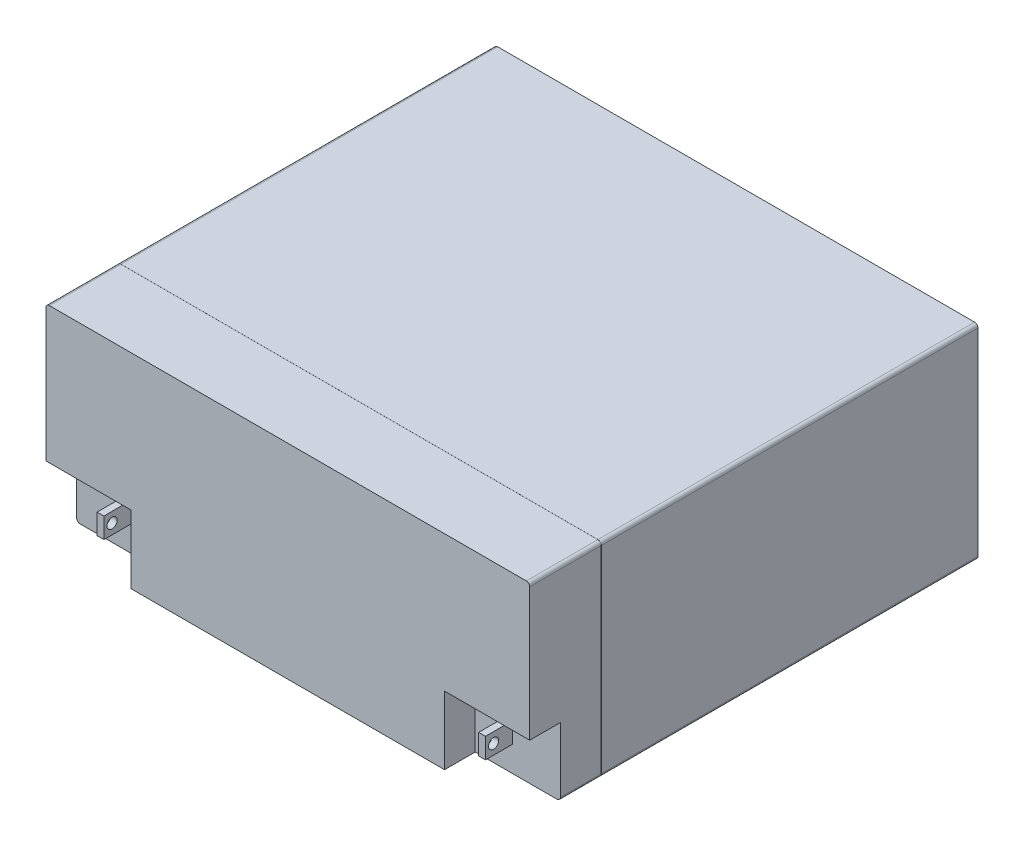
ISO-10303-21;
HEADER;
FILE_DESCRIPTION(('STEP AP214'),'2;1');
FILE_NAME('part.step','',(''),(''),'','','');
FILE_SCHEMA(('AUTOMOTIVE_DESIGN { 1 0 10303 214 1 1 1 1 }'));
ENDSEC;
DATA;
#1=APPLICATION_CONTEXT('core data for automotive mechanical design processes');
#2=APPLICATION_PROTOCOL_DEFINITION('international standard','automotive_design',2000,#1);
#3=PRODUCT_CONTEXT('',#1,'mechanical');
#4=PRODUCT('Part','Part','',(#3));
#5=PRODUCT_RELATED_PRODUCT_CATEGORY('part','',(#4));
#6=PRODUCT_DEFINITION_FORMATION('','',#4);
#7=PRODUCT_DEFINITION_CONTEXT('part definition',#1,'design');
#8=PRODUCT_DEFINITION('design','',#6,#7);
#9=PRODUCT_DEFINITION_SHAPE('','',#8);
#10=(LENGTH_UNIT() NAMED_UNIT(*) SI_UNIT(.MILLI.,.METRE.));
#11=(NAMED_UNIT(*) PLANE_ANGLE_UNIT() SI_UNIT($,.RADIAN.));
#12=(NAMED_UNIT(*) SI_UNIT($,.STERADIAN.) SOLID_ANGLE_UNIT());
#13=UNCERTAINTY_MEASURE_WITH_UNIT(LENGTH_MEASURE(1.E-05),#10,'distance_accuracy_value','');
#14=(GEOMETRIC_REPRESENTATION_CONTEXT(3) GLOBAL_UNCERTAINTY_ASSIGNED_CONTEXT((#13)) GLOBAL_UNIT_ASSIGNED_CONTEXT((#10,
#11,#12)) REPRESENTATION_CONTEXT('',''));
#15=CARTESIAN_POINT('',(0.,0.,0.));
#16=DIRECTION('',(0.,0.,1.));
#17=DIRECTION('',(1.,0.,0.));
#18=AXIS2_PLACEMENT_3D('',#15,#16,#17);
#19=CARTESIAN_POINT('',(72.39,-62.865,77.216));
#20=DIRECTION('',(1.,0.,0.));
#21=DIRECTION('',(0.,0.,1.));
#22=AXIS2_PLACEMENT_3D('',#19,#20,#21);
#23=PLANE('',#22);
#24=DIRECTION('',(0.,-1.,0.));
#25=VECTOR('',#24,1.);
#26=CARTESIAN_POINT('',(72.39,-62.865,72.136));
#27=LINE('',#26,#25);
#28=CARTESIAN_POINT('',(72.39,-59.055,72.136));
#29=VERTEX_POINT('',#28);
#30=CARTESIAN_POINT('',(72.39,-66.675,72.136));
#31=VERTEX_POINT('',#30);
#32=EDGE_CURVE('E482',#29,#31,#27,.T.);
#33=ORIENTED_EDGE('',*,*,#32,.F.);
#34=DIRECTION('',(0.,0.,1.));
#35=VECTOR('',#34,1.);
#36=CARTESIAN_POINT('',(72.39,-59.055,77.216));
#37=LINE('',#36,#35);
#38=CARTESIAN_POINT('',(72.39,-59.055,82.296));
#39=VERTEX_POINT('',#38);
#40=EDGE_CURVE('E392',#29,#39,#37,.T.);
#41=ORIENTED_EDGE('',*,*,#40,.T.);
#42=DIRECTION('',(0.,-1.,0.));
#43=VECTOR('',#42,1.);
#44=CARTESIAN_POINT('',(72.39,-62.865,82.296));
#45=LINE('',#44,#43);
#46=CARTESIAN_POINT('',(72.39,-66.675,82.296));
#47=VERTEX_POINT('',#46);
#48=EDGE_CURVE('E333',#39,#47,#45,.T.);
#49=ORIENTED_EDGE('',*,*,#48,.T.);
#50=DIRECTION('',(0.,0.,1.));
#51=VECTOR('',#50,1.);
#52=CARTESIAN_POINT('',(72.39,-66.675,77.216));
#53=LINE('',#52,#51);
#54=EDGE_CURVE('E21',#31,#47,#53,.T.);
#55=ORIENTED_EDGE('',*,*,#54,.F.);
#56=EDGE_LOOP('',(#33,#41,#49,#55));
#57=FACE_BOUND('',#56,.T.);
#58=CARTESIAN_POINT('',(72.39,-62.865,79.248));
#59=DIRECTION('',(1.,0.,0.));
#60=DIRECTION('',(0.,0.,-1.));
#61=AXIS2_PLACEMENT_3D('',#58,#59,#60);
#62=CIRCLE('',#61,1.905);
#63=CARTESIAN_POINT('',(72.39,-62.865,77.343));
#64=VERTEX_POINT('',#63);
#65=EDGE_CURVE('E38',#64,#64,#62,.T.);
#66=ORIENTED_EDGE('',*,*,#65,.F.);
#67=EDGE_LOOP('',(#66));
#68=FACE_BOUND('',#67,.T.);
#69=ADVANCED_FACE('F17',(#57,#68),#23,.T.);
#70=CARTESIAN_POINT('',(69.85,-62.865,77.216));
#71=DIRECTION('',(1.,0.,0.));
#72=DIRECTION('',(0.,0.,1.));
#73=AXIS2_PLACEMENT_3D('',#70,#71,#72);
#74=PLANE('',#73);
#75=DIRECTION('',(0.,-1.,0.));
#76=VECTOR('',#75,1.);
#77=CARTESIAN_POINT('',(69.85,-62.865,72.136));
#78=LINE('',#77,#76);
#79=CARTESIAN_POINT('',(69.85,-59.055,72.136));
#80=VERTEX_POINT('',#79);
#81=CARTESIAN_POINT('',(69.85,-66.675,72.136));
#82=VERTEX_POINT('',#81);
#83=EDGE_CURVE('E316',#80,#82,#78,.T.);
#84=ORIENTED_EDGE('',*,*,#83,.T.);
#85=DIRECTION('',(0.,0.,1.));
#86=VECTOR('',#85,1.);
#87=CARTESIAN_POINT('',(69.85,-66.675,77.216));
#88=LINE('',#87,#86);
#89=CARTESIAN_POINT('',(69.85,-66.675,82.296));
#90=VERTEX_POINT('',#89);
#91=EDGE_CURVE('E11',#82,#90,#88,.T.);
#92=ORIENTED_EDGE('',*,*,#91,.T.);
#93=DIRECTION('',(0.,-1.,0.));
#94=VECTOR('',#93,1.);
#95=CARTESIAN_POINT('',(69.85,-62.865,82.296));
#96=LINE('',#95,#94);
#97=CARTESIAN_POINT('',(69.85,-59.055,82.296));
#98=VERTEX_POINT('',#97);
#99=EDGE_CURVE('E313',#98,#90,#96,.T.);
#100=ORIENTED_EDGE('',*,*,#99,.F.);
#101=DIRECTION('',(0.,0.,1.));
#102=VECTOR('',#101,1.);
#103=CARTESIAN_POINT('',(69.85,-59.055,77.216));
#104=LINE('',#103,#102);
#105=EDGE_CURVE('E396',#80,#98,#104,.T.);
#106=ORIENTED_EDGE('',*,*,#105,.F.);
#107=EDGE_LOOP('',(#84,#92,#100,#106));
#108=FACE_BOUND('',#107,.T.);
#109=CARTESIAN_POINT('',(69.85,-62.865,79.248));
#110=DIRECTION('',(1.,0.,0.));
#111=DIRECTION('',(0.,0.,-1.));
#112=AXIS2_PLACEMENT_3D('',#109,#110,#111);
#113=CIRCLE('',#112,1.905);
#114=CARTESIAN_POINT('',(69.85,-62.865,77.343));
#115=VERTEX_POINT('',#114);
#116=EDGE_CURVE('E326',#115,#115,#113,.T.);
#117=ORIENTED_EDGE('',*,*,#116,.T.);
#118=EDGE_LOOP('',(#117));
#119=FACE_BOUND('',#118,.T.);
#120=ADVANCED_FACE('F19',(#108,#119),#74,.F.);
#121=CARTESIAN_POINT('',(69.85,-66.675,77.216));
#122=DIRECTION('',(0.,1.,0.));
#123=DIRECTION('',(1.,0.,0.));
#124=AXIS2_PLACEMENT_3D('',#121,#122,#123);
#125=PLANE('',#124);
#126=ORIENTED_EDGE('',*,*,#54,.T.);
#127=DIRECTION('',(1.,0.,0.));
#128=VECTOR('',#127,1.);
#129=CARTESIAN_POINT('',(69.85,-66.675,82.296));
#130=LINE('',#129,#128);
#131=EDGE_CURVE('E321',#90,#47,#130,.T.);
#132=ORIENTED_EDGE('',*,*,#131,.F.);
#133=ORIENTED_EDGE('',*,*,#91,.F.);
#134=DIRECTION('',(1.,0.,0.));
#135=VECTOR('',#134,1.);
#136=CARTESIAN_POINT('',(69.85,-66.675,72.136));
#137=LINE('',#136,#135);
#138=EDGE_CURVE('E397',#82,#31,#137,.T.);
#139=ORIENTED_EDGE('',*,*,#138,.T.);
#140=EDGE_LOOP('',(#126,#132,#133,#139));
#141=FACE_BOUND('',#140,.T.);
#142=ADVANCED_FACE('F322',(#141),#125,.F.);
#143=CARTESIAN_POINT('',(69.85,-62.865,79.248));
#144=DIRECTION('',(1.,0.,0.));
#145=DIRECTION('',(0.,0.,-1.));
#146=AXIS2_PLACEMENT_3D('',#143,#144,#145);
#147=CYLINDRICAL_SURFACE('',#146,1.905);
#148=ORIENTED_EDGE('',*,*,#65,.T.);
#149=EDGE_LOOP('',(#148));
#150=FACE_BOUND('',#149,.T.);
#151=ORIENTED_EDGE('',*,*,#116,.F.);
#152=EDGE_LOOP('',(#151));
#153=FACE_BOUND('',#152,.T.);
#154=ADVANCED_FACE('F995',(#150,#153),#147,.F.);
#155=CARTESIAN_POINT('',(69.85,-62.865,82.296));
#156=DIRECTION('',(0.,0.,1.));
#157=DIRECTION('',(1.,0.,0.));
#158=AXIS2_PLACEMENT_3D('',#155,#156,#157);
#159=PLANE('',#158);
#160=ORIENTED_EDGE('',*,*,#48,.F.);
#161=DIRECTION('',(1.,0.,0.));
#162=VECTOR('',#161,1.);
#163=CARTESIAN_POINT('',(69.85,-59.055,82.296));
#164=LINE('',#163,#162);
#165=EDGE_CURVE('E330',#98,#39,#164,.T.);
#166=ORIENTED_EDGE('',*,*,#165,.F.);
#167=ORIENTED_EDGE('',*,*,#99,.T.);
#168=ORIENTED_EDGE('',*,*,#131,.T.);
#169=EDGE_LOOP('',(#160,#166,#167,#168));
#170=FACE_BOUND('',#169,.T.);
#171=ADVANCED_FACE('F328',(#170),#159,.T.);
#172=CARTESIAN_POINT('',(69.85,-59.055,77.216));
#173=DIRECTION('',(0.,1.,0.));
#174=DIRECTION('',(1.,0.,0.));
#175=AXIS2_PLACEMENT_3D('',#172,#173,#174);
#176=PLANE('',#175);
#177=ORIENTED_EDGE('',*,*,#40,.F.);
#178=DIRECTION('',(1.,0.,0.));
#179=VECTOR('',#178,1.);
#180=CARTESIAN_POINT('',(69.85,-59.055,72.136));
#181=LINE('',#180,#179);
#182=EDGE_CURVE('E478',#80,#29,#181,.T.);
#183=ORIENTED_EDGE('',*,*,#182,.F.);
#184=ORIENTED_EDGE('',*,*,#105,.T.);
#185=ORIENTED_EDGE('',*,*,#165,.T.);
#186=EDGE_LOOP('',(#177,#183,#184,#185));
#187=FACE_BOUND('',#186,.T.);
#188=ADVANCED_FACE('F993',(#187),#176,.T.);
#189=CARTESIAN_POINT('',(0.,-38.1,72.136));
#190=DIRECTION('',(0.,0.,1.));
#191=DIRECTION('',(1.,0.,0.));
#192=AXIS2_PLACEMENT_3D('',#189,#190,#191);
#193=PLANE('',#192);
#194=DIRECTION('',(0.,1.,0.));
#195=VECTOR('',#194,1.);
#196=CARTESIAN_POINT('',(58.42,-63.5,72.136));
#197=LINE('',#196,#195);
#198=CARTESIAN_POINT('',(58.42,-76.2,72.136));
#199=VERTEX_POINT('',#198);
#200=CARTESIAN_POINT('',(58.42,-50.8,72.136));
#201=VERTEX_POINT('',#200);
#202=EDGE_CURVE('E369',#199,#201,#197,.T.);
#203=ORIENTED_EDGE('',*,*,#202,.F.);
#204=DIRECTION('',(-1.,0.,0.));
#205=VECTOR('',#204,1.);
#206=CARTESIAN_POINT('',(0.,-76.2,72.136));
#207=LINE('',#206,#205);
#208=CARTESIAN_POINT('',(88.9,-76.2,72.136));
#209=VERTEX_POINT('',#208);
#210=EDGE_CURVE('E499',#209,#199,#207,.T.);
#211=ORIENTED_EDGE('',*,*,#210,.F.);
#212=CARTESIAN_POINT('',(88.9,-74.93,72.136));
#213=DIRECTION('',(0.,0.,1.));
#214=DIRECTION('',(-1.,0.,0.));
#215=AXIS2_PLACEMENT_3D('',#212,#213,#214);
#216=CIRCLE('',#215,1.27);
#217=CARTESIAN_POINT('',(90.17,-74.93,72.136));
#218=VERTEX_POINT('',#217);
#219=EDGE_CURVE('E588',#209,#218,#216,.T.);
#220=ORIENTED_EDGE('',*,*,#219,.T.);
#221=DIRECTION('',(0.,1.,0.));
#222=VECTOR('',#221,1.);
#223=CARTESIAN_POINT('',(90.17,-76.2,72.136));
#224=LINE('',#223,#222);
#225=CARTESIAN_POINT('',(90.17,-50.8,72.136));
#226=VERTEX_POINT('',#225);
#227=EDGE_CURVE('E513',#218,#226,#224,.T.);
#228=ORIENTED_EDGE('',*,*,#227,.T.);
#229=DIRECTION('',(-1.,0.,0.));
#230=VECTOR('',#229,1.);
#231=CARTESIAN_POINT('',(74.295,-50.8,72.136));
#232=LINE('',#231,#230);
#233=EDGE_CURVE('E479',#226,#201,#232,.T.);
#234=ORIENTED_EDGE('',*,*,#233,.T.);
#235=EDGE_LOOP('',(#203,#211,#220,#228,#234));
#236=FACE_BOUND('',#235,.T.);
#237=ORIENTED_EDGE('',*,*,#83,.F.);
#238=ORIENTED_EDGE('',*,*,#182,.T.);
#239=ORIENTED_EDGE('',*,*,#32,.T.);
#240=ORIENTED_EDGE('',*,*,#138,.F.);
#241=EDGE_LOOP('',(#237,#238,#239,#240));
#242=FACE_BOUND('',#241,.T.);
#243=ADVANCED_FACE('F760',(#236,#242),#193,.T.);
#244=CARTESIAN_POINT('',(74.295,-50.8,72.136));
#245=DIRECTION('',(0.,1.,0.));
#246=DIRECTION('',(1.,0.,0.));
#247=AXIS2_PLACEMENT_3D('',#244,#245,#246);
#248=PLANE('',#247);
#249=DIRECTION('',(-1.,0.,0.));
#250=VECTOR('',#249,1.);
#251=CARTESIAN_POINT('',(74.295,-50.8,83.566));
#252=LINE('',#251,#250);
#253=CARTESIAN_POINT('',(90.17,-50.8,83.566));
#254=VERTEX_POINT('',#253);
#255=CARTESIAN_POINT('',(58.42,-50.8,83.566));
#256=VERTEX_POINT('',#255);
#257=EDGE_CURVE('E563',#254,#256,#252,.T.);
#258=ORIENTED_EDGE('',*,*,#257,.T.);
#259=DIRECTION('',(0.,0.,1.));
#260=VECTOR('',#259,1.);
#261=CARTESIAN_POINT('',(58.42,-50.8,72.136));
#262=LINE('',#261,#260);
#263=EDGE_CURVE('E595',#201,#256,#262,.T.);
#264=ORIENTED_EDGE('',*,*,#263,.F.);
#265=ORIENTED_EDGE('',*,*,#233,.F.);
#266=DIRECTION('',(0.,0.,1.));
#267=VECTOR('',#266,1.);
#268=CARTESIAN_POINT('',(90.17,-50.8,72.136));
#269=LINE('',#268,#267);
#270=EDGE_CURVE('E523',#226,#254,#269,.T.);
#271=ORIENTED_EDGE('',*,*,#270,.T.);
#272=EDGE_LOOP('',(#258,#264,#265,#271));
#273=FACE_BOUND('',#272,.T.);
#274=ADVANCED_FACE('F858',(#273),#248,.F.);
#275=CARTESIAN_POINT('',(58.42,-63.5,72.136));
#276=DIRECTION('',(1.,0.,0.));
#277=DIRECTION('',(0.,1.,0.));
#278=AXIS2_PLACEMENT_3D('',#275,#276,#277);
#279=PLANE('',#278);
#280=DIRECTION('',(0.,1.,0.));
#281=VECTOR('',#280,1.);
#282=CARTESIAN_POINT('',(58.42,-63.5,83.566));
#283=LINE('',#282,#281);
#284=CARTESIAN_POINT('',(58.42,-76.2,83.566));
#285=VERTEX_POINT('',#284);
#286=EDGE_CURVE('E620',#285,#256,#283,.T.);
#287=ORIENTED_EDGE('',*,*,#286,.F.);
#288=DIRECTION('',(0.,0.,1.));
#289=VECTOR('',#288,1.);
#290=CARTESIAN_POINT('',(58.42,-76.2,72.136));
#291=LINE('',#290,#289);
#292=EDGE_CURVE('E503',#199,#285,#291,.T.);
#293=ORIENTED_EDGE('',*,*,#292,.F.);
#294=ORIENTED_EDGE('',*,*,#202,.T.);
#295=ORIENTED_EDGE('',*,*,#263,.T.);
#296=EDGE_LOOP('',(#287,#293,#294,#295));
#297=FACE_BOUND('',#296,.T.);
#298=ADVANCED_FACE('F764',(#297),#279,.T.);
#299=CARTESIAN_POINT('',(0.,-38.1,72.136));
#300=DIRECTION('',(0.,0.,1.));
#301=DIRECTION('',(1.,0.,0.));
#302=AXIS2_PLACEMENT_3D('',#299,#300,#301);
#303=PLANE('',#302);
#304=DIRECTION('',(1.,0.,0.));
#305=VECTOR('',#304,1.);
#306=CARTESIAN_POINT('',(-74.295,-50.8,72.136));
#307=LINE('',#306,#305);
#308=CARTESIAN_POINT('',(-90.17,-50.8,72.136));
#309=VERTEX_POINT('',#308);
#310=CARTESIAN_POINT('',(-58.42,-50.8,72.136));
#311=VERTEX_POINT('',#310);
#312=EDGE_CURVE('E472',#309,#311,#307,.T.);
#313=ORIENTED_EDGE('',*,*,#312,.F.);
#314=DIRECTION('',(0.,1.,0.));
#315=VECTOR('',#314,1.);
#316=CARTESIAN_POINT('',(-90.17,-76.2,72.136));
#317=LINE('',#316,#315);
#318=CARTESIAN_POINT('',(-90.17,-74.93,72.136));
#319=VERTEX_POINT('',#318);
#320=EDGE_CURVE('E562',#319,#309,#317,.T.);
#321=ORIENTED_EDGE('',*,*,#320,.F.);
#322=CARTESIAN_POINT('',(-88.9,-74.93,72.136));
#323=DIRECTION('',(0.,0.,1.));
#324=DIRECTION('',(-1.,0.,0.));
#325=AXIS2_PLACEMENT_3D('',#322,#323,#324);
#326=CIRCLE('',#325,1.27);
#327=CARTESIAN_POINT('',(-88.9,-76.2,72.136));
#328=VERTEX_POINT('',#327);
#329=EDGE_CURVE('E543',#319,#328,#326,.T.);
#330=ORIENTED_EDGE('',*,*,#329,.T.);
#331=DIRECTION('',(-1.,0.,0.));
#332=VECTOR('',#331,1.);
#333=CARTESIAN_POINT('',(0.,-76.2,72.136));
#334=LINE('',#333,#332);
#335=CARTESIAN_POINT('',(-58.42,-76.2,72.136));
#336=VERTEX_POINT('',#335);
#337=EDGE_CURVE('E702',#336,#328,#334,.T.);
#338=ORIENTED_EDGE('',*,*,#337,.F.);
#339=DIRECTION('',(0.,1.,0.));
#340=VECTOR('',#339,1.);
#341=CARTESIAN_POINT('',(-58.42,-63.5,72.136));
#342=LINE('',#341,#340);
#343=EDGE_CURVE('E366',#336,#311,#342,.T.);
#344=ORIENTED_EDGE('',*,*,#343,.T.);
#345=EDGE_LOOP('',(#313,#321,#330,#338,#344));
#346=FACE_BOUND('',#345,.T.);
#347=DIRECTION('',(0.,-1.,0.));
#348=VECTOR('',#347,1.);
#349=CARTESIAN_POINT('',(-69.85,-62.865,72.136));
#350=LINE('',#349,#348);
#351=CARTESIAN_POINT('',(-69.85,-59.055,72.136));
#352=VERTEX_POINT('',#351);
#353=CARTESIAN_POINT('',(-69.85,-66.675,72.136));
#354=VERTEX_POINT('',#353);
#355=EDGE_CURVE('E713',#352,#354,#350,.T.);
#356=ORIENTED_EDGE('',*,*,#355,.T.);
#357=DIRECTION('',(-1.,0.,0.));
#358=VECTOR('',#357,1.);
#359=CARTESIAN_POINT('',(-69.85,-66.675,72.136));
#360=LINE('',#359,#358);
#361=CARTESIAN_POINT('',(-72.39,-66.675,72.136));
#362=VERTEX_POINT('',#361);
#363=EDGE_CURVE('E729',#354,#362,#360,.T.);
#364=ORIENTED_EDGE('',*,*,#363,.T.);
#365=DIRECTION('',(0.,-1.,0.));
#366=VECTOR('',#365,1.);
#367=CARTESIAN_POINT('',(-72.39,-62.865,72.136));
#368=LINE('',#367,#366);
#369=CARTESIAN_POINT('',(-72.39,-59.055,72.136));
#370=VERTEX_POINT('',#369);
#371=EDGE_CURVE('E688',#370,#362,#368,.T.);
#372=ORIENTED_EDGE('',*,*,#371,.F.);
#373=DIRECTION('',(-1.,0.,0.));
#374=VECTOR('',#373,1.);
#375=CARTESIAN_POINT('',(-69.85,-59.055,72.136));
#376=LINE('',#375,#374);
#377=EDGE_CURVE('E692',#352,#370,#376,.T.);
#378=ORIENTED_EDGE('',*,*,#377,.F.);
#379=EDGE_LOOP('',(#356,#364,#372,#378));
#380=FACE_BOUND('',#379,.T.);
#381=ADVANCED_FACE('F879',(#346,#380),#303,.T.);
#382=CARTESIAN_POINT('',(-58.42,-63.5,72.136));
#383=DIRECTION('',(1.,0.,0.));
#384=DIRECTION('',(0.,1.,0.));
#385=AXIS2_PLACEMENT_3D('',#382,#383,#384);
#386=PLANE('',#385);
#387=DIRECTION('',(0.,1.,0.));
#388=VECTOR('',#387,1.);
#389=CARTESIAN_POINT('',(-58.42,-63.5,83.566));
#390=LINE('',#389,#388);
#391=CARTESIAN_POINT('',(-58.42,-76.2,83.566));
#392=VERTEX_POINT('',#391);
#393=CARTESIAN_POINT('',(-58.42,-50.8,83.566));
#394=VERTEX_POINT('',#393);
#395=EDGE_CURVE('E613',#392,#394,#390,.T.);
#396=ORIENTED_EDGE('',*,*,#395,.T.);
#397=DIRECTION('',(0.,0.,1.));
#398=VECTOR('',#397,1.);
#399=CARTESIAN_POINT('',(-58.42,-50.8,72.136));
#400=LINE('',#399,#398);
#401=EDGE_CURVE('E370',#311,#394,#400,.T.);
#402=ORIENTED_EDGE('',*,*,#401,.F.);
#403=ORIENTED_EDGE('',*,*,#343,.F.);
#404=DIRECTION('',(0.,0.,1.));
#405=VECTOR('',#404,1.);
#406=CARTESIAN_POINT('',(-58.42,-76.2,72.136));
#407=LINE('',#406,#405);
#408=EDGE_CURVE('E707',#336,#392,#407,.T.);
#409=ORIENTED_EDGE('',*,*,#408,.T.);
#410=EDGE_LOOP('',(#396,#402,#403,#409));
#411=FACE_BOUND('',#410,.T.);
#412=ADVANCED_FACE('F775',(#411),#386,.F.);
#413=CARTESIAN_POINT('',(-74.295,-50.8,72.136));
#414=DIRECTION('',(0.,-1.,0.));
#415=DIRECTION('',(0.,0.,-1.));
#416=AXIS2_PLACEMENT_3D('',#413,#414,#415);
#417=PLANE('',#416);
#418=DIRECTION('',(1.,0.,0.));
#419=VECTOR('',#418,1.);
#420=CARTESIAN_POINT('',(-74.295,-50.8,83.566));
#421=LINE('',#420,#419);
#422=CARTESIAN_POINT('',(-90.17,-50.8,83.566));
#423=VERTEX_POINT('',#422);
#424=EDGE_CURVE('E609',#423,#394,#421,.T.);
#425=ORIENTED_EDGE('',*,*,#424,.F.);
#426=DIRECTION('',(0.,0.,1.));
#427=VECTOR('',#426,1.);
#428=CARTESIAN_POINT('',(-90.17,-50.8,72.136));
#429=LINE('',#428,#427);
#430=EDGE_CURVE('E631',#309,#423,#429,.T.);
#431=ORIENTED_EDGE('',*,*,#430,.F.);
#432=ORIENTED_EDGE('',*,*,#312,.T.);
#433=ORIENTED_EDGE('',*,*,#401,.T.);
#434=EDGE_LOOP('',(#425,#431,#432,#433));
#435=FACE_BOUND('',#434,.T.);
#436=ADVANCED_FACE('F877',(#435),#417,.T.);
#437=CARTESIAN_POINT('',(90.17,-76.2,0.));
#438=DIRECTION('',(1.,0.,0.));
#439=DIRECTION('',(0.,0.,1.));
#440=AXIS2_PLACEMENT_3D('',#437,#438,#439);
#441=PLANE('',#440);
#442=DIRECTION('',(0.,1.,0.));
#443=VECTOR('',#442,1.);
#444=CARTESIAN_POINT('',(90.17,-38.1,56.8706));
#445=LINE('',#444,#443);
#446=CARTESIAN_POINT('',(90.17,-74.93,56.8706));
#447=VERTEX_POINT('',#446);
#448=CARTESIAN_POINT('',(90.17,-1.27000000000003,56.8706));
#449=VERTEX_POINT('',#448);
#450=EDGE_CURVE('E435',#447,#449,#445,.T.);
#451=ORIENTED_EDGE('',*,*,#450,.F.);
#452=DIRECTION('',(0.,0.,-1.));
#453=VECTOR('',#452,1.);
#454=CARTESIAN_POINT('',(90.17,-74.93,0.));
#455=LINE('',#454,#453);
#456=CARTESIAN_POINT('',(90.17,-74.93,-83.566));
#457=VERTEX_POINT('',#456);
#458=EDGE_CURVE('E456',#447,#457,#455,.T.);
#459=ORIENTED_EDGE('',*,*,#458,.T.);
#460=DIRECTION('',(0.,1.,0.));
#461=VECTOR('',#460,1.);
#462=CARTESIAN_POINT('',(90.17,-76.2,-83.566));
#463=LINE('',#462,#461);
#464=CARTESIAN_POINT('',(90.17,-1.27000000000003,-83.566));
#465=VERTEX_POINT('',#464);
#466=EDGE_CURVE('E449',#457,#465,#463,.T.);
#467=ORIENTED_EDGE('',*,*,#466,.T.);
#468=DIRECTION('',(0.,0.,1.));
#469=VECTOR('',#468,1.);
#470=CARTESIAN_POINT('',(90.17,-1.27,83.566));
#471=LINE('',#470,#469);
#472=EDGE_CURVE('E466',#465,#449,#471,.T.);
#473=ORIENTED_EDGE('',*,*,#472,.T.);
#474=EDGE_LOOP('',(#451,#459,#467,#473));
#475=FACE_BOUND('',#474,.T.);
#476=ADVANCED_FACE('F932',(#475),#441,.T.);
#477=CARTESIAN_POINT('',(-90.17,-76.2,0.));
#478=DIRECTION('',(1.,0.,0.));
#479=DIRECTION('',(0.,0.,1.));
#480=AXIS2_PLACEMENT_3D('',#477,#478,#479);
#481=PLANE('',#480);
#482=DIRECTION('',(0.,-1.,0.));
#483=VECTOR('',#482,1.);
#484=CARTESIAN_POINT('',(-90.17,-38.1,56.8706));
#485=LINE('',#484,#483);
#486=CARTESIAN_POINT('',(-90.17,-1.27000000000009,56.8706));
#487=VERTEX_POINT('',#486);
#488=CARTESIAN_POINT('',(-90.17,-74.93,56.8706));
#489=VERTEX_POINT('',#488);
#490=EDGE_CURVE('E352',#487,#489,#485,.T.);
#491=ORIENTED_EDGE('',*,*,#490,.F.);
#492=DIRECTION('',(0.,0.,-1.));
#493=VECTOR('',#492,1.);
#494=CARTESIAN_POINT('',(-90.17,-1.27,0.));
#495=LINE('',#494,#493);
#496=CARTESIAN_POINT('',(-90.17,-1.27000000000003,-83.566));
#497=VERTEX_POINT('',#496);
#498=EDGE_CURVE('E464',#487,#497,#495,.T.);
#499=ORIENTED_EDGE('',*,*,#498,.T.);
#500=DIRECTION('',(0.,1.,0.));
#501=VECTOR('',#500,1.);
#502=CARTESIAN_POINT('',(-90.17,-76.2,-83.566));
#503=LINE('',#502,#501);
#504=CARTESIAN_POINT('',(-90.17,-74.93,-83.566));
#505=VERTEX_POINT('',#504);
#506=EDGE_CURVE('E439',#505,#497,#503,.T.);
#507=ORIENTED_EDGE('',*,*,#506,.F.);
#508=DIRECTION('',(0.,0.,1.));
#509=VECTOR('',#508,1.);
#510=CARTESIAN_POINT('',(-90.17,-74.93,83.566));
#511=LINE('',#510,#509);
#512=EDGE_CURVE('E459',#505,#489,#511,.T.);
#513=ORIENTED_EDGE('',*,*,#512,.T.);
#514=EDGE_LOOP('',(#491,#499,#507,#513));
#515=FACE_BOUND('',#514,.T.);
#516=ADVANCED_FACE('F965',(#515),#481,.F.);
#517=CARTESIAN_POINT('',(0.,0.,0.));
#518=DIRECTION('',(0.,-1.,0.));
#519=DIRECTION('',(0.,0.,-1.));
#520=AXIS2_PLACEMENT_3D('',#517,#518,#519);
#521=PLANE('',#520);
#522=DIRECTION('',(-1.,0.,0.));
#523=VECTOR('',#522,1.);
#524=CARTESIAN_POINT('',(0.,0.,56.8706));
#525=LINE('',#524,#523);
#526=CARTESIAN_POINT('',(88.9,0.,56.8706));
#527=VERTEX_POINT('',#526);
#528=CARTESIAN_POINT('',(-88.9,0.,56.8706));
#529=VERTEX_POINT('',#528);
#530=EDGE_CURVE('E404',#527,#529,#525,.T.);
#531=ORIENTED_EDGE('',*,*,#530,.F.);
#532=DIRECTION('',(0.,0.,-1.));
#533=VECTOR('',#532,1.);
#534=CARTESIAN_POINT('',(88.9,0.,-83.566));
#535=LINE('',#534,#533);
#536=CARTESIAN_POINT('',(88.9,0.,-83.566));
#537=VERTEX_POINT('',#536);
#538=EDGE_CURVE('E469',#527,#537,#535,.T.);
#539=ORIENTED_EDGE('',*,*,#538,.T.);
#540=DIRECTION('',(-1.,0.,0.));
#541=VECTOR('',#540,1.);
#542=CARTESIAN_POINT('',(0.,0.,-83.566));
#543=LINE('',#542,#541);
#544=CARTESIAN_POINT('',(-88.9,0.,-83.566));
#545=VERTEX_POINT('',#544);
#546=EDGE_CURVE('E440',#537,#545,#543,.T.);
#547=ORIENTED_EDGE('',*,*,#546,.T.);
#548=DIRECTION('',(0.,0.,1.));
#549=VECTOR('',#548,1.);
#550=CARTESIAN_POINT('',(-88.9,0.,0.));
#551=LINE('',#550,#549);
#552=EDGE_CURVE('E461',#545,#529,#551,.T.);
#553=ORIENTED_EDGE('',*,*,#552,.T.);
#554=EDGE_LOOP('',(#531,#539,#547,#553));
#555=FACE_BOUND('',#554,.T.);
#556=ADVANCED_FACE('F961',(#555),#521,.F.);
#557=CARTESIAN_POINT('',(88.9,-1.27,0.));
#558=DIRECTION('',(0.,0.,1.));
#559=DIRECTION('',(1.,0.,0.));
#560=AXIS2_PLACEMENT_3D('',#557,#558,#559);
#561=CYLINDRICAL_SURFACE('',#560,1.27);
#562=CARTESIAN_POINT('',(88.9,-1.27,56.8706));
#563=DIRECTION('',(0.,0.,1.));
#564=DIRECTION('',(1.,0.,0.));
#565=AXIS2_PLACEMENT_3D('',#562,#563,#564);
#566=CIRCLE('',#565,1.27);
#567=EDGE_CURVE('E400',#449,#527,#566,.T.);
#568=ORIENTED_EDGE('',*,*,#567,.F.);
#569=ORIENTED_EDGE('',*,*,#472,.F.);
#570=CARTESIAN_POINT('',(88.9,-1.27,-83.566));
#571=DIRECTION('',(0.,0.,-1.));
#572=DIRECTION('',(-1.,0.,0.));
#573=AXIS2_PLACEMENT_3D('',#570,#571,#572);
#574=CIRCLE('',#573,1.27);
#575=EDGE_CURVE('E444',#537,#465,#574,.T.);
#576=ORIENTED_EDGE('',*,*,#575,.F.);
#577=ORIENTED_EDGE('',*,*,#538,.F.);
#578=EDGE_LOOP('',(#568,#569,#576,#577));
#579=FACE_BOUND('',#578,.T.);
#580=ADVANCED_FACE('F964',(#579),#561,.T.);
#581=CARTESIAN_POINT('',(-88.9,-1.27,0.));
#582=DIRECTION('',(0.,0.,-1.));
#583=DIRECTION('',(-1.,0.,0.));
#584=AXIS2_PLACEMENT_3D('',#581,#582,#583);
#585=CYLINDRICAL_SURFACE('',#584,1.27);
#586=CARTESIAN_POINT('',(-88.9,-1.27,56.8706));
#587=DIRECTION('',(0.,0.,1.));
#588=DIRECTION('',(1.,0.,0.));
#589=AXIS2_PLACEMENT_3D('',#586,#587,#588);
#590=CIRCLE('',#589,1.27);
#591=EDGE_CURVE('E356',#529,#487,#590,.T.);
#592=ORIENTED_EDGE('',*,*,#591,.F.);
#593=ORIENTED_EDGE('',*,*,#552,.F.);
#594=CARTESIAN_POINT('',(-88.9,-1.27,-83.566));
#595=DIRECTION('',(0.,0.,-1.));
#596=DIRECTION('',(-1.,0.,0.));
#597=AXIS2_PLACEMENT_3D('',#594,#595,#596);
#598=CIRCLE('',#597,1.27);
#599=EDGE_CURVE('E445',#497,#545,#598,.T.);
#600=ORIENTED_EDGE('',*,*,#599,.F.);
#601=ORIENTED_EDGE('',*,*,#498,.F.);
#602=EDGE_LOOP('',(#592,#593,#600,#601));
#603=FACE_BOUND('',#602,.T.);
#604=ADVANCED_FACE('F969',(#603),#585,.T.);
#605=CARTESIAN_POINT('',(0.,-76.2,0.));
#606=DIRECTION('',(0.,-1.,0.));
#607=DIRECTION('',(0.,0.,-1.));
#608=AXIS2_PLACEMENT_3D('',#605,#606,#607);
#609=PLANE('',#608);
#610=DIRECTION('',(1.,0.,0.));
#611=VECTOR('',#610,1.);
#612=CARTESIAN_POINT('',(0.,-76.2,56.8706));
#613=LINE('',#612,#611);
#614=CARTESIAN_POINT('',(-88.9,-76.2,56.8706));
#615=VERTEX_POINT('',#614);
#616=CARTESIAN_POINT('',(88.9,-76.2,56.8706));
#617=VERTEX_POINT('',#616);
#618=EDGE_CURVE('E430',#615,#617,#613,.T.);
#619=ORIENTED_EDGE('',*,*,#618,.F.);
#620=DIRECTION('',(0.,0.,-1.));
#621=VECTOR('',#620,1.);
#622=CARTESIAN_POINT('',(-88.9,-76.2,-83.566));
#623=LINE('',#622,#621);
#624=CARTESIAN_POINT('',(-88.9,-76.2,-83.566));
#625=VERTEX_POINT('',#624);
#626=EDGE_CURVE('E465',#615,#625,#623,.T.);
#627=ORIENTED_EDGE('',*,*,#626,.T.);
#628=DIRECTION('',(-1.,0.,0.));
#629=VECTOR('',#628,1.);
#630=CARTESIAN_POINT('',(0.,-76.2,-83.566));
#631=LINE('',#630,#629);
#632=CARTESIAN_POINT('',(88.9,-76.2,-83.566));
#633=VERTEX_POINT('',#632);
#634=EDGE_CURVE('E450',#633,#625,#631,.T.);
#635=ORIENTED_EDGE('',*,*,#634,.F.);
#636=DIRECTION('',(0.,0.,1.));
#637=VECTOR('',#636,1.);
#638=CARTESIAN_POINT('',(88.9,-76.2,0.));
#639=LINE('',#638,#637);
#640=EDGE_CURVE('E460',#633,#617,#639,.T.);
#641=ORIENTED_EDGE('',*,*,#640,.T.);
#642=EDGE_LOOP('',(#619,#627,#635,#641));
#643=FACE_BOUND('',#642,.T.);
#644=ADVANCED_FACE('F959',(#643),#609,.T.);
#645=CARTESIAN_POINT('',(-88.9,-74.93,0.));
#646=DIRECTION('',(0.,0.,1.));
#647=DIRECTION('',(1.,0.,0.));
#648=AXIS2_PLACEMENT_3D('',#645,#646,#647);
#649=CYLINDRICAL_SURFACE('',#648,1.27);
#650=CARTESIAN_POINT('',(-88.9,-74.93,56.8706));
#651=DIRECTION('',(0.,0.,1.));
#652=DIRECTION('',(1.,0.,0.));
#653=AXIS2_PLACEMENT_3D('',#650,#651,#652);
#654=CIRCLE('',#653,1.27);
#655=EDGE_CURVE('E355',#489,#615,#654,.T.);
#656=ORIENTED_EDGE('',*,*,#655,.F.);
#657=ORIENTED_EDGE('',*,*,#512,.F.);
#658=CARTESIAN_POINT('',(-88.9,-74.93,-83.566));
#659=DIRECTION('',(0.,0.,-1.));
#660=DIRECTION('',(-1.,0.,0.));
#661=AXIS2_PLACEMENT_3D('',#658,#659,#660);
#662=CIRCLE('',#661,1.27);
#663=EDGE_CURVE('E454',#625,#505,#662,.T.);
#664=ORIENTED_EDGE('',*,*,#663,.F.);
#665=ORIENTED_EDGE('',*,*,#626,.F.);
#666=EDGE_LOOP('',(#656,#657,#664,#665));
#667=FACE_BOUND('',#666,.T.);
#668=ADVANCED_FACE('F955',(#667),#649,.T.);
#669=CARTESIAN_POINT('',(88.9,-74.93,0.));
#670=DIRECTION('',(0.,0.,-1.));
#671=DIRECTION('',(-1.,0.,0.));
#672=AXIS2_PLACEMENT_3D('',#669,#670,#671);
#673=CYLINDRICAL_SURFACE('',#672,1.27);
#674=CARTESIAN_POINT('',(88.9,-74.93,56.8706));
#675=DIRECTION('',(0.,0.,1.));
#676=DIRECTION('',(1.,0.,0.));
#677=AXIS2_PLACEMENT_3D('',#674,#675,#676);
#678=CIRCLE('',#677,1.27);
#679=EDGE_CURVE('E434',#617,#447,#678,.T.);
#680=ORIENTED_EDGE('',*,*,#679,.F.);
#681=ORIENTED_EDGE('',*,*,#640,.F.);
#682=CARTESIAN_POINT('',(88.9,-74.93,-83.566));
#683=DIRECTION('',(0.,0.,-1.));
#684=DIRECTION('',(-1.,0.,0.));
#685=AXIS2_PLACEMENT_3D('',#682,#683,#684);
#686=CIRCLE('',#685,1.27);
#687=EDGE_CURVE('E455',#457,#633,#686,.T.);
#688=ORIENTED_EDGE('',*,*,#687,.F.);
#689=ORIENTED_EDGE('',*,*,#458,.F.);
#690=EDGE_LOOP('',(#680,#681,#688,#689));
#691=FACE_BOUND('',#690,.T.);
#692=ADVANCED_FACE('F951',(#691),#673,.T.);
#693=CARTESIAN_POINT('',(0.,-76.2,-83.566));
#694=DIRECTION('',(0.,0.,-1.));
#695=DIRECTION('',(0.,-1.,0.));
#696=AXIS2_PLACEMENT_3D('',#693,#694,#695);
#697=PLANE('',#696);
#698=ORIENTED_EDGE('',*,*,#506,.T.);
#699=ORIENTED_EDGE('',*,*,#599,.T.);
#700=ORIENTED_EDGE('',*,*,#546,.F.);
#701=ORIENTED_EDGE('',*,*,#575,.T.);
#702=ORIENTED_EDGE('',*,*,#466,.F.);
#703=ORIENTED_EDGE('',*,*,#687,.T.);
#704=ORIENTED_EDGE('',*,*,#634,.T.);
#705=ORIENTED_EDGE('',*,*,#663,.T.);
#706=EDGE_LOOP('',(#698,#699,#700,#701,#702,#703,#704,#705));
#707=FACE_BOUND('',#706,.T.);
#708=ADVANCED_FACE('F948',(#707),#697,.T.);
#709=CARTESIAN_POINT('',(0.,-38.1,56.896));
#710=DIRECTION('',(0.,0.,1.));
#711=DIRECTION('',(1.,0.,0.));
#712=AXIS2_PLACEMENT_3D('',#709,#710,#711);
#713=PLANE('',#712);
#714=CARTESIAN_POINT('',(88.9,-1.27,56.896));
#715=DIRECTION('',(0.,0.,1.));
#716=DIRECTION('',(1.,0.,0.));
#717=AXIS2_PLACEMENT_3D('',#714,#715,#716);
#718=CIRCLE('',#717,1.27);
#719=CARTESIAN_POINT('',(90.17,-1.27000000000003,56.896));
#720=VERTEX_POINT('',#719);
#721=CARTESIAN_POINT('',(88.9,0.,56.896));
#722=VERTEX_POINT('',#721);
#723=EDGE_CURVE('E555',#720,#722,#718,.T.);
#724=ORIENTED_EDGE('',*,*,#723,.F.);
#725=DIRECTION('',(0.,1.,0.));
#726=VECTOR('',#725,1.);
#727=CARTESIAN_POINT('',(90.17,-38.1,56.896));
#728=LINE('',#727,#726);
#729=CARTESIAN_POINT('',(90.17,-74.93,56.896));
#730=VERTEX_POINT('',#729);
#731=EDGE_CURVE('E518',#730,#720,#728,.T.);
#732=ORIENTED_EDGE('',*,*,#731,.F.);
#733=CARTESIAN_POINT('',(88.9,-74.93,56.896));
#734=DIRECTION('',(0.,0.,1.));
#735=DIRECTION('',(1.,0.,0.));
#736=AXIS2_PLACEMENT_3D('',#733,#734,#735);
#737=CIRCLE('',#736,1.27);
#738=CARTESIAN_POINT('',(88.9,-76.2,56.896));
#739=VERTEX_POINT('',#738);
#740=EDGE_CURVE('E584',#739,#730,#737,.T.);
#741=ORIENTED_EDGE('',*,*,#740,.F.);
#742=DIRECTION('',(1.,0.,0.));
#743=VECTOR('',#742,1.);
#744=CARTESIAN_POINT('',(0.,-76.2,56.896));
#745=LINE('',#744,#743);
#746=CARTESIAN_POINT('',(-88.9,-76.2,56.896));
#747=VERTEX_POINT('',#746);
#748=EDGE_CURVE('E495',#747,#739,#745,.T.);
#749=ORIENTED_EDGE('',*,*,#748,.F.);
#750=CARTESIAN_POINT('',(-88.9,-74.93,56.896));
#751=DIRECTION('',(0.,0.,1.));
#752=DIRECTION('',(1.,0.,0.));
#753=AXIS2_PLACEMENT_3D('',#750,#751,#752);
#754=CIRCLE('',#753,1.27);
#755=CARTESIAN_POINT('',(-90.17,-74.93,56.896));
#756=VERTEX_POINT('',#755);
#757=EDGE_CURVE('E550',#756,#747,#754,.T.);
#758=ORIENTED_EDGE('',*,*,#757,.F.);
#759=DIRECTION('',(0.,-1.,0.));
#760=VECTOR('',#759,1.);
#761=CARTESIAN_POINT('',(-90.17,-38.1,56.896));
#762=LINE('',#761,#760);
#763=CARTESIAN_POINT('',(-90.17,-1.27000000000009,56.896));
#764=VERTEX_POINT('',#763);
#765=EDGE_CURVE('E637',#764,#756,#762,.T.);
#766=ORIENTED_EDGE('',*,*,#765,.F.);
#767=CARTESIAN_POINT('',(-88.9,-1.27,56.896));
#768=DIRECTION('',(0.,0.,1.));
#769=DIRECTION('',(1.,0.,0.));
#770=AXIS2_PLACEMENT_3D('',#767,#768,#769);
#771=CIRCLE('',#770,1.27);
#772=CARTESIAN_POINT('',(-88.9,0.,56.896));
#773=VERTEX_POINT('',#772);
#774=EDGE_CURVE('E529',#773,#764,#771,.T.);
#775=ORIENTED_EDGE('',*,*,#774,.F.);
#776=DIRECTION('',(-1.,0.,0.));
#777=VECTOR('',#776,1.);
#778=CARTESIAN_POINT('',(0.,0.,56.896));
#779=LINE('',#778,#777);
#780=EDGE_CURVE('E640',#722,#773,#779,.T.);
#781=ORIENTED_EDGE('',*,*,#780,.F.);
#782=EDGE_LOOP('',(#724,#732,#741,#749,#758,#766,#775,#781));
#783=FACE_BOUND('',#782,.T.);
#784=CARTESIAN_POINT('',(-88.9,-1.27,56.896));
#785=DIRECTION('',(0.,0.,1.));
#786=DIRECTION('',(1.,0.,0.));
#787=AXIS2_PLACEMENT_3D('',#784,#785,#786);
#788=CIRCLE('',#787,1.2446);
#789=CARTESIAN_POINT('',(-88.9,-0.0254000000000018,56.896));
#790=VERTEX_POINT('',#789);
#791=CARTESIAN_POINT('',(-90.1446,-1.27,56.896));
#792=VERTEX_POINT('',#791);
#793=EDGE_CURVE('E643',#790,#792,#788,.T.);
#794=ORIENTED_EDGE('',*,*,#793,.T.);
#795=DIRECTION('',(0.,-1.,0.));
#796=VECTOR('',#795,1.);
#797=CARTESIAN_POINT('',(-90.1446,-38.1,56.896));
#798=LINE('',#797,#796);
#799=CARTESIAN_POINT('',(-90.1446,-74.93,56.896));
#800=VERTEX_POINT('',#799);
#801=EDGE_CURVE('E426',#792,#800,#798,.T.);
#802=ORIENTED_EDGE('',*,*,#801,.T.);
#803=CARTESIAN_POINT('',(-88.9,-74.93,56.896));
#804=DIRECTION('',(0.,0.,1.));
#805=DIRECTION('',(1.,0.,0.));
#806=AXIS2_PLACEMENT_3D('',#803,#804,#805);
#807=CIRCLE('',#806,1.2446);
#808=CARTESIAN_POINT('',(-88.9,-76.1746,56.896));
#809=VERTEX_POINT('',#808);
#810=EDGE_CURVE('E422',#800,#809,#807,.T.);
#811=ORIENTED_EDGE('',*,*,#810,.T.);
#812=DIRECTION('',(1.,0.,0.));
#813=VECTOR('',#812,1.);
#814=CARTESIAN_POINT('',(0.,-76.1746,56.896));
#815=LINE('',#814,#813);
#816=CARTESIAN_POINT('',(88.9,-76.1746,56.896));
#817=VERTEX_POINT('',#816);
#818=EDGE_CURVE('E419',#809,#817,#815,.T.);
#819=ORIENTED_EDGE('',*,*,#818,.T.);
#820=CARTESIAN_POINT('',(88.9,-74.93,56.896));
#821=DIRECTION('',(0.,0.,1.));
#822=DIRECTION('',(1.,0.,0.));
#823=AXIS2_PLACEMENT_3D('',#820,#821,#822);
#824=CIRCLE('',#823,1.2446);
#825=CARTESIAN_POINT('',(90.1446,-74.93,56.896));
#826=VERTEX_POINT('',#825);
#827=EDGE_CURVE('E408',#817,#826,#824,.T.);
#828=ORIENTED_EDGE('',*,*,#827,.T.);
#829=DIRECTION('',(0.,1.,0.));
#830=VECTOR('',#829,1.);
#831=CARTESIAN_POINT('',(90.1446,-38.1,56.896));
#832=LINE('',#831,#830);
#833=CARTESIAN_POINT('',(90.1446,-1.27,56.896));
#834=VERTEX_POINT('',#833);
#835=EDGE_CURVE('E376',#826,#834,#832,.T.);
#836=ORIENTED_EDGE('',*,*,#835,.T.);
#837=CARTESIAN_POINT('',(88.9,-1.27,56.896));
#838=DIRECTION('',(0.,0.,1.));
#839=DIRECTION('',(1.,0.,0.));
#840=AXIS2_PLACEMENT_3D('',#837,#838,#839);
#841=CIRCLE('',#840,1.2446);
#842=CARTESIAN_POINT('',(88.9,-0.0254000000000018,56.896));
#843=VERTEX_POINT('',#842);
#844=EDGE_CURVE('E384',#834,#843,#841,.T.);
#845=ORIENTED_EDGE('',*,*,#844,.T.);
#846=DIRECTION('',(-1.,0.,0.));
#847=VECTOR('',#846,1.);
#848=CARTESIAN_POINT('',(0.,-0.0254000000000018,56.896));
#849=LINE('',#848,#847);
#850=EDGE_CURVE('E365',#843,#790,#849,.T.);
#851=ORIENTED_EDGE('',*,*,#850,.T.);
#852=EDGE_LOOP('',(#794,#802,#811,#819,#828,#836,#845,#851));
#853=FACE_BOUND('',#852,.T.);
#854=ADVANCED_FACE('F668',(#783,#853),#713,.F.);
#855=CARTESIAN_POINT('',(0.,-38.1,56.8706));
#856=DIRECTION('',(0.,0.,1.));
#857=DIRECTION('',(1.,0.,0.));
#858=AXIS2_PLACEMENT_3D('',#855,#856,#857);
#859=PLANE('',#858);
#860=ORIENTED_EDGE('',*,*,#567,.T.);
#861=ORIENTED_EDGE('',*,*,#530,.T.);
#862=ORIENTED_EDGE('',*,*,#591,.T.);
#863=ORIENTED_EDGE('',*,*,#490,.T.);
#864=ORIENTED_EDGE('',*,*,#655,.T.);
#865=ORIENTED_EDGE('',*,*,#618,.T.);
#866=ORIENTED_EDGE('',*,*,#679,.T.);
#867=ORIENTED_EDGE('',*,*,#450,.T.);
#868=EDGE_LOOP('',(#860,#861,#862,#863,#864,#865,#866,#867));
#869=FACE_BOUND('',#868,.T.);
#870=CARTESIAN_POINT('',(-88.9,-1.27,56.8706));
#871=DIRECTION('',(0.,0.,1.));
#872=DIRECTION('',(1.,0.,0.));
#873=AXIS2_PLACEMENT_3D('',#870,#871,#872);
#874=CIRCLE('',#873,1.2446);
#875=CARTESIAN_POINT('',(-88.9,-0.0254000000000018,56.8706));
#876=VERTEX_POINT('',#875);
#877=CARTESIAN_POINT('',(-90.1446,-1.27,56.8706));
#878=VERTEX_POINT('',#877);
#879=EDGE_CURVE('E357',#876,#878,#874,.T.);
#880=ORIENTED_EDGE('',*,*,#879,.F.);
#881=DIRECTION('',(-1.,0.,0.));
#882=VECTOR('',#881,1.);
#883=CARTESIAN_POINT('',(0.,-0.0254000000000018,56.8706));
#884=LINE('',#883,#882);
#885=CARTESIAN_POINT('',(88.9,-0.0254000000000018,56.8706));
#886=VERTEX_POINT('',#885);
#887=EDGE_CURVE('E381',#886,#876,#884,.T.);
#888=ORIENTED_EDGE('',*,*,#887,.F.);
#889=CARTESIAN_POINT('',(88.9,-1.27,56.8706));
#890=DIRECTION('',(0.,0.,1.));
#891=DIRECTION('',(1.,0.,0.));
#892=AXIS2_PLACEMENT_3D('',#889,#890,#891);
#893=CIRCLE('',#892,1.2446);
#894=CARTESIAN_POINT('',(90.1446,-1.27,56.8706));
#895=VERTEX_POINT('',#894);
#896=EDGE_CURVE('E391',#895,#886,#893,.T.);
#897=ORIENTED_EDGE('',*,*,#896,.F.);
#898=DIRECTION('',(0.,1.,0.));
#899=VECTOR('',#898,1.);
#900=CARTESIAN_POINT('',(90.1446,-38.1,56.8706));
#901=LINE('',#900,#899);
#902=CARTESIAN_POINT('',(90.1446,-74.93,56.8706));
#903=VERTEX_POINT('',#902);
#904=EDGE_CURVE('E375',#903,#895,#901,.T.);
#905=ORIENTED_EDGE('',*,*,#904,.F.);
#906=CARTESIAN_POINT('',(88.9,-74.93,56.8706));
#907=DIRECTION('',(0.,0.,1.));
#908=DIRECTION('',(1.,0.,0.));
#909=AXIS2_PLACEMENT_3D('',#906,#907,#908);
#910=CIRCLE('',#909,1.2446);
#911=CARTESIAN_POINT('',(88.9,-76.1746,56.8706));
#912=VERTEX_POINT('',#911);
#913=EDGE_CURVE('E413',#912,#903,#910,.T.);
#914=ORIENTED_EDGE('',*,*,#913,.F.);
#915=DIRECTION('',(1.,0.,0.));
#916=VECTOR('',#915,1.);
#917=CARTESIAN_POINT('',(0.,-76.1746,56.8706));
#918=LINE('',#917,#916);
#919=CARTESIAN_POINT('',(-88.9,-76.1746,56.8706));
#920=VERTEX_POINT('',#919);
#921=EDGE_CURVE('E418',#920,#912,#918,.T.);
#922=ORIENTED_EDGE('',*,*,#921,.F.);
#923=CARTESIAN_POINT('',(-88.9,-74.93,56.8706));
#924=DIRECTION('',(0.,0.,1.));
#925=DIRECTION('',(1.,0.,0.));
#926=AXIS2_PLACEMENT_3D('',#923,#924,#925);
#927=CIRCLE('',#926,1.2446);
#928=CARTESIAN_POINT('',(-90.1446,-74.93,56.8706));
#929=VERTEX_POINT('',#928);
#930=EDGE_CURVE('E423',#929,#920,#927,.T.);
#931=ORIENTED_EDGE('',*,*,#930,.F.);
#932=DIRECTION('',(0.,-1.,0.));
#933=VECTOR('',#932,1.);
#934=CARTESIAN_POINT('',(-90.1446,-38.1,56.8706));
#935=LINE('',#934,#933);
#936=EDGE_CURVE('E405',#878,#929,#935,.T.);
#937=ORIENTED_EDGE('',*,*,#936,.F.);
#938=EDGE_LOOP('',(#880,#888,#897,#905,#914,#922,#931,#937));
#939=FACE_BOUND('',#938,.T.);
#940=ADVANCED_FACE('F942',(#869,#939),#859,.T.);
#941=CARTESIAN_POINT('',(-90.1446,-38.1,56.8706));
#942=DIRECTION('',(-1.,0.,0.));
#943=DIRECTION('',(0.,0.,1.));
#944=AXIS2_PLACEMENT_3D('',#941,#942,#943);
#945=PLANE('',#944);
#946=ORIENTED_EDGE('',*,*,#801,.F.);
#947=DIRECTION('',(0.,0.,1.));
#948=VECTOR('',#947,1.);
#949=CARTESIAN_POINT('',(-90.1446,-1.27,56.8706));
#950=LINE('',#949,#948);
#951=EDGE_CURVE('E361',#878,#792,#950,.T.);
#952=ORIENTED_EDGE('',*,*,#951,.F.);
#953=ORIENTED_EDGE('',*,*,#936,.T.);
#954=DIRECTION('',(0.,0.,1.));
#955=VECTOR('',#954,1.);
#956=CARTESIAN_POINT('',(-90.1446,-74.93,56.8706));
#957=LINE('',#956,#955);
#958=EDGE_CURVE('E427',#929,#800,#957,.T.);
#959=ORIENTED_EDGE('',*,*,#958,.T.);
#960=EDGE_LOOP('',(#946,#952,#953,#959));
#961=FACE_BOUND('',#960,.T.);
#962=ADVANCED_FACE('F664',(#961),#945,.T.);
#963=CARTESIAN_POINT('',(-88.9,-74.93,56.8706));
#964=DIRECTION('',(0.,0.,1.));
#965=DIRECTION('',(1.,0.,0.));
#966=AXIS2_PLACEMENT_3D('',#963,#964,#965);
#967=CYLINDRICAL_SURFACE('',#966,1.2446);
#968=ORIENTED_EDGE('',*,*,#810,.F.);
#969=ORIENTED_EDGE('',*,*,#958,.F.);
#970=ORIENTED_EDGE('',*,*,#930,.T.);
#971=DIRECTION('',(0.,0.,1.));
#972=VECTOR('',#971,1.);
#973=CARTESIAN_POINT('',(-88.9,-76.1746,56.8706));
#974=LINE('',#973,#972);
#975=EDGE_CURVE('E414',#920,#809,#974,.T.);
#976=ORIENTED_EDGE('',*,*,#975,.T.);
#977=EDGE_LOOP('',(#968,#969,#970,#976));
#978=FACE_BOUND('',#977,.T.);
#979=ADVANCED_FACE('F675',(#978),#967,.T.);
#980=CARTESIAN_POINT('',(0.,-76.1746,56.8706));
#981=DIRECTION('',(0.,-1.,0.));
#982=DIRECTION('',(0.,0.,-1.));
#983=AXIS2_PLACEMENT_3D('',#980,#981,#982);
#984=PLANE('',#983);
#985=ORIENTED_EDGE('',*,*,#818,.F.);
#986=ORIENTED_EDGE('',*,*,#975,.F.);
#987=ORIENTED_EDGE('',*,*,#921,.T.);
#988=DIRECTION('',(0.,0.,1.));
#989=VECTOR('',#988,1.);
#990=CARTESIAN_POINT('',(88.9,-76.1746,56.8706));
#991=LINE('',#990,#989);
#992=EDGE_CURVE('E409',#912,#817,#991,.T.);
#993=ORIENTED_EDGE('',*,*,#992,.T.);
#994=EDGE_LOOP('',(#985,#986,#987,#993));
#995=FACE_BOUND('',#994,.T.);
#996=ADVANCED_FACE('F678',(#995),#984,.T.);
#997=CARTESIAN_POINT('',(88.9,-74.93,56.8706));
#998=DIRECTION('',(0.,0.,1.));
#999=DIRECTION('',(1.,0.,0.));
#1000=AXIS2_PLACEMENT_3D('',#997,#998,#999);
#1001=CYLINDRICAL_SURFACE('',#1000,1.2446);
#1002=ORIENTED_EDGE('',*,*,#827,.F.);
#1003=ORIENTED_EDGE('',*,*,#992,.F.);
#1004=ORIENTED_EDGE('',*,*,#913,.T.);
#1005=DIRECTION('',(0.,0.,1.));
#1006=VECTOR('',#1005,1.);
#1007=CARTESIAN_POINT('',(90.1446,-74.93,56.8706));
#1008=LINE('',#1007,#1006);
#1009=EDGE_CURVE('E371',#903,#826,#1008,.T.);
#1010=ORIENTED_EDGE('',*,*,#1009,.T.);
#1011=EDGE_LOOP('',(#1002,#1003,#1004,#1010));
#1012=FACE_BOUND('',#1011,.T.);
#1013=ADVANCED_FACE('F928',(#1012),#1001,.T.);
#1014=CARTESIAN_POINT('',(90.1446,-38.1,56.8706));
#1015=DIRECTION('',(1.,0.,0.));
#1016=DIRECTION('',(0.,1.,0.));
#1017=AXIS2_PLACEMENT_3D('',#1014,#1015,#1016);
#1018=PLANE('',#1017);
#1019=ORIENTED_EDGE('',*,*,#835,.F.);
#1020=ORIENTED_EDGE('',*,*,#1009,.F.);
#1021=ORIENTED_EDGE('',*,*,#904,.T.);
#1022=DIRECTION('',(0.,0.,1.));
#1023=VECTOR('',#1022,1.);
#1024=CARTESIAN_POINT('',(90.1446,-1.27,56.8706));
#1025=LINE('',#1024,#1023);
#1026=EDGE_CURVE('E387',#895,#834,#1025,.T.);
#1027=ORIENTED_EDGE('',*,*,#1026,.T.);
#1028=EDGE_LOOP('',(#1019,#1020,#1021,#1027));
#1029=FACE_BOUND('',#1028,.T.);
#1030=ADVANCED_FACE('F924',(#1029),#1018,.T.);
#1031=CARTESIAN_POINT('',(88.9,-1.27,56.8706));
#1032=DIRECTION('',(0.,0.,1.));
#1033=DIRECTION('',(1.,0.,0.));
#1034=AXIS2_PLACEMENT_3D('',#1031,#1032,#1033);
#1035=CYLINDRICAL_SURFACE('',#1034,1.2446);
#1036=ORIENTED_EDGE('',*,*,#844,.F.);
#1037=ORIENTED_EDGE('',*,*,#1026,.F.);
#1038=ORIENTED_EDGE('',*,*,#896,.T.);
#1039=DIRECTION('',(0.,0.,1.));
#1040=VECTOR('',#1039,1.);
#1041=CARTESIAN_POINT('',(88.9,-0.0254000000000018,56.8706));
#1042=LINE('',#1041,#1040);
#1043=EDGE_CURVE('E377',#886,#843,#1042,.T.);
#1044=ORIENTED_EDGE('',*,*,#1043,.T.);
#1045=EDGE_LOOP('',(#1036,#1037,#1038,#1044));
#1046=FACE_BOUND('',#1045,.T.);
#1047=ADVANCED_FACE('F921',(#1046),#1035,.T.);
#1048=CARTESIAN_POINT('',(0.,-0.0254000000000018,56.8706));
#1049=DIRECTION('',(0.,1.,0.));
#1050=DIRECTION('',(1.,0.,0.));
#1051=AXIS2_PLACEMENT_3D('',#1048,#1049,#1050);
#1052=PLANE('',#1051);
#1053=ORIENTED_EDGE('',*,*,#850,.F.);
#1054=ORIENTED_EDGE('',*,*,#1043,.F.);
#1055=ORIENTED_EDGE('',*,*,#887,.T.);
#1056=DIRECTION('',(0.,0.,1.));
#1057=VECTOR('',#1056,1.);
#1058=CARTESIAN_POINT('',(-88.9,-0.0254000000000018,56.8706));
#1059=LINE('',#1058,#1057);
#1060=EDGE_CURVE('E350',#876,#790,#1059,.T.);
#1061=ORIENTED_EDGE('',*,*,#1060,.T.);
#1062=EDGE_LOOP('',(#1053,#1054,#1055,#1061));
#1063=FACE_BOUND('',#1062,.T.);
#1064=ADVANCED_FACE('F656',(#1063),#1052,.T.);
#1065=CARTESIAN_POINT('',(-88.9,-1.27,56.8706));
#1066=DIRECTION('',(0.,0.,1.));
#1067=DIRECTION('',(1.,0.,0.));
#1068=AXIS2_PLACEMENT_3D('',#1065,#1066,#1067);
#1069=CYLINDRICAL_SURFACE('',#1068,1.2446);
#1070=ORIENTED_EDGE('',*,*,#793,.F.);
#1071=ORIENTED_EDGE('',*,*,#1060,.F.);
#1072=ORIENTED_EDGE('',*,*,#879,.T.);
#1073=ORIENTED_EDGE('',*,*,#951,.T.);
#1074=EDGE_LOOP('',(#1070,#1071,#1072,#1073));
#1075=FACE_BOUND('',#1074,.T.);
#1076=ADVANCED_FACE('F661',(#1075),#1069,.T.);
#1077=CARTESIAN_POINT('',(0.,0.,0.));
#1078=DIRECTION('',(0.,-1.,0.));
#1079=DIRECTION('',(0.,0.,-1.));
#1080=AXIS2_PLACEMENT_3D('',#1077,#1078,#1079);
#1081=PLANE('',#1080);
#1082=DIRECTION('',(0.,0.,-1.));
#1083=VECTOR('',#1082,1.);
#1084=CARTESIAN_POINT('',(88.9,0.,-83.566));
#1085=LINE('',#1084,#1083);
#1086=CARTESIAN_POINT('',(88.9,0.,83.566));
#1087=VERTEX_POINT('',#1086);
#1088=EDGE_CURVE('E567',#1087,#722,#1085,.T.);
#1089=ORIENTED_EDGE('',*,*,#1088,.T.);
#1090=ORIENTED_EDGE('',*,*,#780,.T.);
#1091=DIRECTION('',(0.,0.,1.));
#1092=VECTOR('',#1091,1.);
#1093=CARTESIAN_POINT('',(-88.9,0.,0.));
#1094=LINE('',#1093,#1092);
#1095=CARTESIAN_POINT('',(-88.9,0.,83.566));
#1096=VERTEX_POINT('',#1095);
#1097=EDGE_CURVE('E525',#773,#1096,#1094,.T.);
#1098=ORIENTED_EDGE('',*,*,#1097,.T.);
#1099=DIRECTION('',(-1.,0.,0.));
#1100=VECTOR('',#1099,1.);
#1101=CARTESIAN_POINT('',(0.,0.,83.566));
#1102=LINE('',#1101,#1100);
#1103=EDGE_CURVE('E559',#1087,#1096,#1102,.T.);
#1104=ORIENTED_EDGE('',*,*,#1103,.F.);
#1105=EDGE_LOOP('',(#1089,#1090,#1098,#1104));
#1106=FACE_BOUND('',#1105,.T.);
#1107=ADVANCED_FACE('F867',(#1106),#1081,.F.);
#1108=CARTESIAN_POINT('',(-90.17,-76.2,0.));
#1109=DIRECTION('',(1.,0.,0.));
#1110=DIRECTION('',(0.,0.,1.));
#1111=AXIS2_PLACEMENT_3D('',#1108,#1109,#1110);
#1112=PLANE('',#1111);
#1113=ORIENTED_EDGE('',*,*,#320,.T.);
#1114=ORIENTED_EDGE('',*,*,#430,.T.);
#1115=DIRECTION('',(0.,1.,0.));
#1116=VECTOR('',#1115,1.);
#1117=CARTESIAN_POINT('',(-90.17,-76.2,83.566));
#1118=LINE('',#1117,#1116);
#1119=CARTESIAN_POINT('',(-90.17,-1.27000000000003,83.566));
#1120=VERTEX_POINT('',#1119);
#1121=EDGE_CURVE('E587',#423,#1120,#1118,.T.);
#1122=ORIENTED_EDGE('',*,*,#1121,.T.);
#1123=DIRECTION('',(0.,0.,-1.));
#1124=VECTOR('',#1123,1.);
#1125=CARTESIAN_POINT('',(-90.17,-1.27,0.));
#1126=LINE('',#1125,#1124);
#1127=EDGE_CURVE('E533',#1120,#764,#1126,.T.);
#1128=ORIENTED_EDGE('',*,*,#1127,.T.);
#1129=ORIENTED_EDGE('',*,*,#765,.T.);
#1130=DIRECTION('',(0.,0.,1.));
#1131=VECTOR('',#1130,1.);
#1132=CARTESIAN_POINT('',(-90.17,-74.93,83.566));
#1133=LINE('',#1132,#1131);
#1134=EDGE_CURVE('E546',#756,#319,#1133,.T.);
#1135=ORIENTED_EDGE('',*,*,#1134,.T.);
#1136=EDGE_LOOP('',(#1113,#1114,#1122,#1128,#1129,#1135));
#1137=FACE_BOUND('',#1136,.T.);
#1138=ADVANCED_FACE('F874',(#1137),#1112,.F.);
#1139=CARTESIAN_POINT('',(0.,-76.2,83.566));
#1140=DIRECTION('',(0.,0.,-1.));
#1141=DIRECTION('',(0.,-1.,0.));
#1142=AXIS2_PLACEMENT_3D('',#1139,#1140,#1141);
#1143=PLANE('',#1142);
#1144=ORIENTED_EDGE('',*,*,#1121,.F.);
#1145=ORIENTED_EDGE('',*,*,#424,.T.);
#1146=ORIENTED_EDGE('',*,*,#395,.F.);
#1147=DIRECTION('',(-1.,0.,0.));
#1148=VECTOR('',#1147,1.);
#1149=CARTESIAN_POINT('',(0.,-76.2,83.566));
#1150=LINE('',#1149,#1148);
#1151=EDGE_CURVE('E509',#285,#392,#1150,.T.);
#1152=ORIENTED_EDGE('',*,*,#1151,.F.);
#1153=ORIENTED_EDGE('',*,*,#286,.T.);
#1154=ORIENTED_EDGE('',*,*,#257,.F.);
#1155=DIRECTION('',(0.,1.,0.));
#1156=VECTOR('',#1155,1.);
#1157=CARTESIAN_POINT('',(90.17,-76.2,83.566));
#1158=LINE('',#1157,#1156);
#1159=CARTESIAN_POINT('',(90.17,-1.27000000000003,83.566));
#1160=VERTEX_POINT('',#1159);
#1161=EDGE_CURVE('E519',#254,#1160,#1158,.T.);
#1162=ORIENTED_EDGE('',*,*,#1161,.T.);
#1163=CARTESIAN_POINT('',(88.9,-1.27,83.566));
#1164=DIRECTION('',(0.,0.,1.));
#1165=DIRECTION('',(-1.,0.,0.));
#1166=AXIS2_PLACEMENT_3D('',#1163,#1164,#1165);
#1167=CIRCLE('',#1166,1.27);
#1168=EDGE_CURVE('E577',#1160,#1087,#1167,.T.);
#1169=ORIENTED_EDGE('',*,*,#1168,.T.);
#1170=ORIENTED_EDGE('',*,*,#1103,.T.);
#1171=CARTESIAN_POINT('',(-88.9,-1.27,83.566));
#1172=DIRECTION('',(0.,0.,1.));
#1173=DIRECTION('',(-1.,0.,0.));
#1174=AXIS2_PLACEMENT_3D('',#1171,#1172,#1173);
#1175=CIRCLE('',#1174,1.27);
#1176=EDGE_CURVE('E539',#1096,#1120,#1175,.T.);
#1177=ORIENTED_EDGE('',*,*,#1176,.T.);
#1178=EDGE_LOOP('',(#1144,#1145,#1146,#1152,#1153,#1154,#1162,#1169,#1170,#1177));
#1179=FACE_BOUND('',#1178,.T.);
#1180=ADVANCED_FACE('F771',(#1179),#1143,.F.);
#1181=CARTESIAN_POINT('',(88.9,-74.93,0.));
#1182=DIRECTION('',(0.,0.,-1.));
#1183=DIRECTION('',(-1.,0.,0.));
#1184=AXIS2_PLACEMENT_3D('',#1181,#1182,#1183);
#1185=CYLINDRICAL_SURFACE('',#1184,1.27);
#1186=ORIENTED_EDGE('',*,*,#219,.F.);
#1187=DIRECTION('',(0.,0.,1.));
#1188=VECTOR('',#1187,1.);
#1189=CARTESIAN_POINT('',(88.9,-76.2,0.));
#1190=LINE('',#1189,#1188);
#1191=EDGE_CURVE('E496',#739,#209,#1190,.T.);
#1192=ORIENTED_EDGE('',*,*,#1191,.F.);
#1193=ORIENTED_EDGE('',*,*,#740,.T.);
#1194=DIRECTION('',(0.,0.,-1.));
#1195=VECTOR('',#1194,1.);
#1196=CARTESIAN_POINT('',(90.17,-74.93,0.));
#1197=LINE('',#1196,#1195);
#1198=EDGE_CURVE('E514',#218,#730,#1197,.T.);
#1199=ORIENTED_EDGE('',*,*,#1198,.F.);
#1200=EDGE_LOOP('',(#1186,#1192,#1193,#1199));
#1201=FACE_BOUND('',#1200,.T.);
#1202=ADVANCED_FACE('F756',(#1201),#1185,.T.);
#1203=CARTESIAN_POINT('',(88.9,-1.27,0.));
#1204=DIRECTION('',(0.,0.,1.));
#1205=DIRECTION('',(1.,0.,0.));
#1206=AXIS2_PLACEMENT_3D('',#1203,#1204,#1205);
#1207=CYLINDRICAL_SURFACE('',#1206,1.27);
#1208=DIRECTION('',(0.,0.,1.));
#1209=VECTOR('',#1208,1.);
#1210=CARTESIAN_POINT('',(90.17,-1.27,83.566));
#1211=LINE('',#1210,#1209);
#1212=EDGE_CURVE('E524',#720,#1160,#1211,.T.);
#1213=ORIENTED_EDGE('',*,*,#1212,.F.);
#1214=ORIENTED_EDGE('',*,*,#723,.T.);
#1215=ORIENTED_EDGE('',*,*,#1088,.F.);
#1216=ORIENTED_EDGE('',*,*,#1168,.F.);
#1217=EDGE_LOOP('',(#1213,#1214,#1215,#1216));
#1218=FACE_BOUND('',#1217,.T.);
#1219=ADVANCED_FACE('F865',(#1218),#1207,.T.);
#1220=CARTESIAN_POINT('',(-88.9,-74.93,0.));
#1221=DIRECTION('',(0.,0.,1.));
#1222=DIRECTION('',(1.,0.,0.));
#1223=AXIS2_PLACEMENT_3D('',#1220,#1221,#1222);
#1224=CYLINDRICAL_SURFACE('',#1223,1.27);
#1225=ORIENTED_EDGE('',*,*,#329,.F.);
#1226=ORIENTED_EDGE('',*,*,#1134,.F.);
#1227=ORIENTED_EDGE('',*,*,#757,.T.);
#1228=DIRECTION('',(0.,0.,-1.));
#1229=VECTOR('',#1228,1.);
#1230=CARTESIAN_POINT('',(-88.9,-76.2,-83.566));
#1231=LINE('',#1230,#1229);
#1232=EDGE_CURVE('E706',#328,#747,#1231,.T.);
#1233=ORIENTED_EDGE('',*,*,#1232,.F.);
#1234=EDGE_LOOP('',(#1225,#1226,#1227,#1233));
#1235=FACE_BOUND('',#1234,.T.);
#1236=ADVANCED_FACE('F883',(#1235),#1224,.T.);
#1237=CARTESIAN_POINT('',(-88.9,-1.27,0.));
#1238=DIRECTION('',(0.,0.,-1.));
#1239=DIRECTION('',(-1.,0.,0.));
#1240=AXIS2_PLACEMENT_3D('',#1237,#1238,#1239);
#1241=CYLINDRICAL_SURFACE('',#1240,1.27);
#1242=ORIENTED_EDGE('',*,*,#1097,.F.);
#1243=ORIENTED_EDGE('',*,*,#774,.T.);
#1244=ORIENTED_EDGE('',*,*,#1127,.F.);
#1245=ORIENTED_EDGE('',*,*,#1176,.F.);
#1246=EDGE_LOOP('',(#1242,#1243,#1244,#1245));
#1247=FACE_BOUND('',#1246,.T.);
#1248=ADVANCED_FACE('F871',(#1247),#1241,.T.);
#1249=CARTESIAN_POINT('',(90.17,-76.2,0.));
#1250=DIRECTION('',(1.,0.,0.));
#1251=DIRECTION('',(0.,0.,1.));
#1252=AXIS2_PLACEMENT_3D('',#1249,#1250,#1251);
#1253=PLANE('',#1252);
#1254=ORIENTED_EDGE('',*,*,#227,.F.);
#1255=ORIENTED_EDGE('',*,*,#1198,.T.);
#1256=ORIENTED_EDGE('',*,*,#731,.T.);
#1257=ORIENTED_EDGE('',*,*,#1212,.T.);
#1258=ORIENTED_EDGE('',*,*,#1161,.F.);
#1259=ORIENTED_EDGE('',*,*,#270,.F.);
#1260=EDGE_LOOP('',(#1254,#1255,#1256,#1257,#1258,#1259));
#1261=FACE_BOUND('',#1260,.T.);
#1262=ADVANCED_FACE('F860',(#1261),#1253,.T.);
#1263=CARTESIAN_POINT('',(0.,-76.2,0.));
#1264=DIRECTION('',(0.,-1.,0.));
#1265=DIRECTION('',(0.,0.,-1.));
#1266=AXIS2_PLACEMENT_3D('',#1263,#1264,#1265);
#1267=PLANE('',#1266);
#1268=ORIENTED_EDGE('',*,*,#408,.F.);
#1269=ORIENTED_EDGE('',*,*,#337,.T.);
#1270=ORIENTED_EDGE('',*,*,#1232,.T.);
#1271=ORIENTED_EDGE('',*,*,#748,.T.);
#1272=ORIENTED_EDGE('',*,*,#1191,.T.);
#1273=ORIENTED_EDGE('',*,*,#210,.T.);
#1274=ORIENTED_EDGE('',*,*,#292,.T.);
#1275=ORIENTED_EDGE('',*,*,#1151,.T.);
#1276=EDGE_LOOP('',(#1268,#1269,#1270,#1271,#1272,#1273,#1274,#1275));
#1277=FACE_BOUND('',#1276,.T.);
#1278=ADVANCED_FACE('F748',(#1277),#1267,.T.);
#1279=CARTESIAN_POINT('',(-69.85,-62.865,77.216));
#1280=DIRECTION('',(-1.,0.,0.));
#1281=DIRECTION('',(0.,1.,0.));
#1282=AXIS2_PLACEMENT_3D('',#1279,#1280,#1281);
#1283=PLANE('',#1282);
#1284=ORIENTED_EDGE('',*,*,#355,.F.);
#1285=DIRECTION('',(0.,0.,1.));
#1286=VECTOR('',#1285,1.);
#1287=CARTESIAN_POINT('',(-69.85,-59.055,77.216));
#1288=LINE('',#1287,#1286);
#1289=CARTESIAN_POINT('',(-69.85,-59.055,82.296));
#1290=VERTEX_POINT('',#1289);
#1291=EDGE_CURVE('E697',#352,#1290,#1288,.T.);
#1292=ORIENTED_EDGE('',*,*,#1291,.T.);
#1293=DIRECTION('',(0.,-1.,0.));
#1294=VECTOR('',#1293,1.);
#1295=CARTESIAN_POINT('',(-69.85,-62.865,82.296));
#1296=LINE('',#1295,#1294);
#1297=CARTESIAN_POINT('',(-69.85,-66.675,82.296));
#1298=VERTEX_POINT('',#1297);
#1299=EDGE_CURVE('E712',#1290,#1298,#1296,.T.);
#1300=ORIENTED_EDGE('',*,*,#1299,.T.);
#1301=DIRECTION('',(0.,0.,1.));
#1302=VECTOR('',#1301,1.);
#1303=CARTESIAN_POINT('',(-69.85,-66.675,77.216));
#1304=LINE('',#1303,#1302);
#1305=EDGE_CURVE('E730',#354,#1298,#1304,.T.);
#1306=ORIENTED_EDGE('',*,*,#1305,.F.);
#1307=EDGE_LOOP('',(#1284,#1292,#1300,#1306));
#1308=FACE_BOUND('',#1307,.T.);
#1309=CARTESIAN_POINT('',(-69.85,-62.865,79.248));
#1310=DIRECTION('',(1.,0.,0.));
#1311=DIRECTION('',(0.,0.,-1.));
#1312=AXIS2_PLACEMENT_3D('',#1309,#1310,#1311);
#1313=CIRCLE('',#1312,1.905);
#1314=CARTESIAN_POINT('',(-69.85,-62.865,77.343));
#1315=VERTEX_POINT('',#1314);
#1316=EDGE_CURVE('E1266',#1315,#1315,#1313,.T.);
#1317=ORIENTED_EDGE('',*,*,#1316,.F.);
#1318=EDGE_LOOP('',(#1317));
#1319=FACE_BOUND('',#1318,.T.);
#1320=ADVANCED_FACE('F907',(#1308,#1319),#1283,.F.);
#1321=CARTESIAN_POINT('',(-72.39,-62.865,77.216));
#1322=DIRECTION('',(-1.,0.,0.));
#1323=DIRECTION('',(0.,1.,0.));
#1324=AXIS2_PLACEMENT_3D('',#1321,#1322,#1323);
#1325=PLANE('',#1324);
#1326=ORIENTED_EDGE('',*,*,#371,.T.);
#1327=DIRECTION('',(0.,0.,1.));
#1328=VECTOR('',#1327,1.);
#1329=CARTESIAN_POINT('',(-72.39,-66.675,77.216));
#1330=LINE('',#1329,#1328);
#1331=CARTESIAN_POINT('',(-72.39,-66.675,82.296));
#1332=VERTEX_POINT('',#1331);
#1333=EDGE_CURVE('E725',#362,#1332,#1330,.T.);
#1334=ORIENTED_EDGE('',*,*,#1333,.T.);
#1335=DIRECTION('',(0.,-1.,0.));
#1336=VECTOR('',#1335,1.);
#1337=CARTESIAN_POINT('',(-72.39,-62.865,82.296));
#1338=LINE('',#1337,#1336);
#1339=CARTESIAN_POINT('',(-72.39,-59.055,82.296));
#1340=VERTEX_POINT('',#1339);
#1341=EDGE_CURVE('E696',#1340,#1332,#1338,.T.);
#1342=ORIENTED_EDGE('',*,*,#1341,.F.);
#1343=DIRECTION('',(0.,0.,1.));
#1344=VECTOR('',#1343,1.);
#1345=CARTESIAN_POINT('',(-72.39,-59.055,77.216));
#1346=LINE('',#1345,#1344);
#1347=EDGE_CURVE('E840',#370,#1340,#1346,.T.);
#1348=ORIENTED_EDGE('',*,*,#1347,.F.);
#1349=EDGE_LOOP('',(#1326,#1334,#1342,#1348));
#1350=FACE_BOUND('',#1349,.T.);
#1351=CARTESIAN_POINT('',(-72.39,-62.865,79.248));
#1352=DIRECTION('',(1.,0.,0.));
#1353=DIRECTION('',(0.,0.,-1.));
#1354=AXIS2_PLACEMENT_3D('',#1351,#1352,#1353);
#1355=CIRCLE('',#1354,1.905);
#1356=CARTESIAN_POINT('',(-72.39,-62.865,77.343));
#1357=VERTEX_POINT('',#1356);
#1358=EDGE_CURVE('E843',#1357,#1357,#1355,.T.);
#1359=ORIENTED_EDGE('',*,*,#1358,.T.);
#1360=EDGE_LOOP('',(#1359));
#1361=FACE_BOUND('',#1360,.T.);
#1362=ADVANCED_FACE('F813',(#1350,#1361),#1325,.T.);
#1363=CARTESIAN_POINT('',(-69.85,-66.675,77.216));
#1364=DIRECTION('',(0.,1.,0.));
#1365=DIRECTION('',(1.,0.,0.));
#1366=AXIS2_PLACEMENT_3D('',#1363,#1364,#1365);
#1367=PLANE('',#1366);
#1368=ORIENTED_EDGE('',*,*,#1333,.F.);
#1369=ORIENTED_EDGE('',*,*,#363,.F.);
#1370=ORIENTED_EDGE('',*,*,#1305,.T.);
#1371=DIRECTION('',(-1.,0.,0.));
#1372=VECTOR('',#1371,1.);
#1373=CARTESIAN_POINT('',(-69.85,-66.675,82.296));
#1374=LINE('',#1373,#1372);
#1375=EDGE_CURVE('E708',#1298,#1332,#1374,.T.);
#1376=ORIENTED_EDGE('',*,*,#1375,.T.);
#1377=EDGE_LOOP('',(#1368,#1369,#1370,#1376));
#1378=FACE_BOUND('',#1377,.T.);
#1379=ADVANCED_FACE('F822',(#1378),#1367,.F.);
#1380=CARTESIAN_POINT('',(-69.85,-62.865,82.296));
#1381=DIRECTION('',(0.,0.,1.));
#1382=DIRECTION('',(1.,0.,0.));
#1383=AXIS2_PLACEMENT_3D('',#1380,#1381,#1382);
#1384=PLANE('',#1383);
#1385=ORIENTED_EDGE('',*,*,#1341,.T.);
#1386=ORIENTED_EDGE('',*,*,#1375,.F.);
#1387=ORIENTED_EDGE('',*,*,#1299,.F.);
#1388=DIRECTION('',(-1.,0.,0.));
#1389=VECTOR('',#1388,1.);
#1390=CARTESIAN_POINT('',(-69.85,-59.055,82.296));
#1391=LINE('',#1390,#1389);
#1392=EDGE_CURVE('E701',#1290,#1340,#1391,.T.);
#1393=ORIENTED_EDGE('',*,*,#1392,.T.);
#1394=EDGE_LOOP('',(#1385,#1386,#1387,#1393));
#1395=FACE_BOUND('',#1394,.T.);
#1396=ADVANCED_FACE('F825',(#1395),#1384,.T.);
#1397=CARTESIAN_POINT('',(-69.85,-59.055,77.216));
#1398=DIRECTION('',(0.,1.,0.));
#1399=DIRECTION('',(1.,0.,0.));
#1400=AXIS2_PLACEMENT_3D('',#1397,#1398,#1399);
#1401=PLANE('',#1400);
#1402=ORIENTED_EDGE('',*,*,#1347,.T.);
#1403=ORIENTED_EDGE('',*,*,#1392,.F.);
#1404=ORIENTED_EDGE('',*,*,#1291,.F.);
#1405=ORIENTED_EDGE('',*,*,#377,.T.);
#1406=EDGE_LOOP('',(#1402,#1403,#1404,#1405));
#1407=FACE_BOUND('',#1406,.T.);
#1408=ADVANCED_FACE('F1008',(#1407),#1401,.T.);
#1409=CARTESIAN_POINT('',(-69.85,-62.865,79.248));
#1410=DIRECTION('',(-1.,0.,0.));
#1411=DIRECTION('',(0.,0.,-1.));
#1412=AXIS2_PLACEMENT_3D('',#1409,#1410,#1411);
#1413=CYLINDRICAL_SURFACE('',#1412,1.905);
#1414=ORIENTED_EDGE('',*,*,#1358,.F.);
#1415=EDGE_LOOP('',(#1414));
#1416=FACE_BOUND('',#1415,.T.);
#1417=ORIENTED_EDGE('',*,*,#1316,.T.);
#1418=EDGE_LOOP('',(#1417));
#1419=FACE_BOUND('',#1418,.T.);
#1420=ADVANCED_FACE('F1240',(#1416,#1419),#1413,.F.);
#1421=CLOSED_SHELL('',(#69,#120,#142,#154,#171,#188,#243,#274,#298,#381,#412,#436,#476,#516,
#556,#580,#604,#644,#668,#692,#708,#854,#940,#962,#979,#996,#1013,#1030,#1047,#1064,#1076,#1107,
#1138,#1180,#1202,#1219,#1236,#1248,#1262,#1278,#1320,#1362,#1379,#1396,#1408,#1420));
#1422=MANIFOLD_SOLID_BREP('B1',#1421);
#1423=ADVANCED_BREP_SHAPE_REPRESENTATION('',(#18,#1422),#14);
#1424=SHAPE_DEFINITION_REPRESENTATION(#9,#1423);
ENDSEC;
END-ISO-10303-21;
